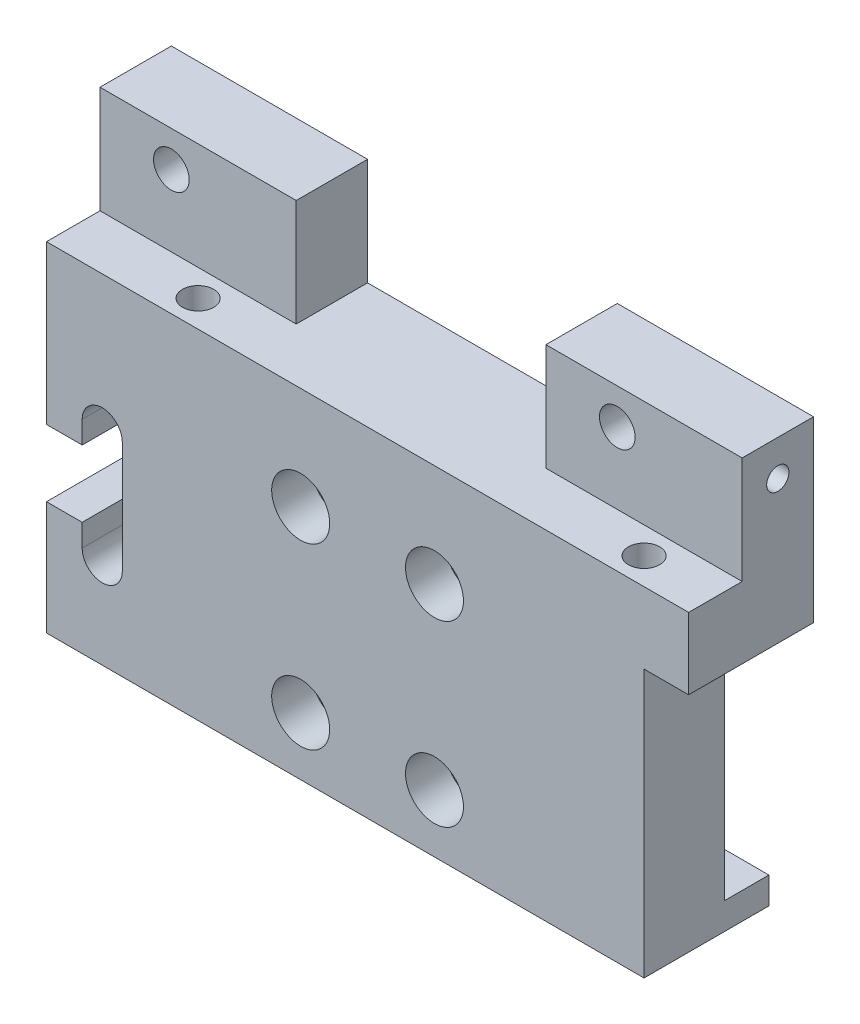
from build123d import *

# Parameters (mm, degrees)
SKETCH_1_R          = 2
SKETCH_1_R_2        = 1.75
EXTRUDE_1_DEPTH     = 14
SKETCH_2_R          = 3.25
CUT_EXTRUDE_1_DEPTH = 4.5
SKETCH_3_OUTSIDE_W  = 33.754
SKETCH_3_OUTSIDE_H  = 69.754
CUT_EXTRUDE_2_DEPTH = 89.769364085
SKETCH_4_R          = 1.25
CUT_EXTRUDE_3_DEPTH = 14
SKETCH_5_R          = 1.5
CUT_EXTRUDE_4_DEPTH = 8
SKETCH_6_R          = 1.75
CUT_EXTRUDE_5_DEPTH = 8


with BuildPart() as part:
    # Sketch 1 → Extrude 1 (new body)
    with BuildSketch(Plane.XY):
        with BuildLine():
            Line((0, 0), (0, 12.75))
            Line((0, 12.75), (4, 12.75))
            Line((4, 12.75), (4, 10.25))
            ThreePointArc((4, 10.25), (6.25, 8), (8.5, 10.25))
            Line((8.5, 10.25), (8.5, 22.75))
            ThreePointArc((8.5, 22.75), (6.25, 25), (4, 22.75))
            Line((4, 22.75), (4, 20.25))
            Line((4, 20.25), (0, 20.25))
            Line((0, 20.25), (0, 50))
            Line((0, 50), (22, 50))
            Line((22, 50), (22, 38))
            Line((22, 38), (50, 38))
            Line((50, 38), (50, 50))
            Line((50, 50), (72, 50))
            Line((72, 50), (72, 30))
            Line((72, 30), (67, 30))
            Line((67, 30), (67, 0))
            Line((67, 0), (0, 0))
        make_face()
        with Locations((8, 46)):
            Circle(SKETCH_1_R, mode=Mode.SUBTRACT)
        with Locations((58, 46)):
            Circle(SKETCH_1_R, mode=Mode.SUBTRACT)
        with Locations((28.5, 6.5)):
            Circle(SKETCH_1_R_2, mode=Mode.SUBTRACT)
        with Locations((43.5, 6.5)):
            Circle(SKETCH_1_R_2, mode=Mode.SUBTRACT)
        with Locations((28.5, 26.5)):
            Circle(SKETCH_1_R_2, mode=Mode.SUBTRACT)
        with Locations((43.5, 26.5)):
            Circle(SKETCH_1_R_2, mode=Mode.SUBTRACT)
    extrude(amount=EXTRUDE_1_DEPTH)

    # Sketch 2 → Cut-Extrude 1 (cut)
    with BuildSketch(Plane.XY.offset(14)):
        with Locations((28.5, 6.5)):
            Circle(SKETCH_2_R)
        with Locations((43.5, 6.5)):
            Circle(SKETCH_2_R)
        with Locations((28.5, 26.5)):
            Circle(SKETCH_2_R)
        with Locations((43.5, 26.5)):
            Circle(SKETCH_2_R)
    extrude(amount=-CUT_EXTRUDE_1_DEPTH, mode=Mode.SUBTRACT)

    # Sketch 3 outside → Cut-Extrude 2 (cut, through all)
    with BuildSketch(Plane(origin=(72, 0, 0), x_dir=(0, 0, -1), z_dir=(1, 0, 0))):
        with Locations((-7, 25)):
            Rectangle(SKETCH_3_OUTSIDE_W, SKETCH_3_OUTSIDE_H)
        Polygon((-8, 38), (-8, 50), (0, 50), (0, 30), (-5, 30), (-5, 3), (0, 3), (0, 0), (-14, 0), (-14, 38), align=None, mode=Mode.SUBTRACT)
    extrude(amount=-CUT_EXTRUDE_2_DEPTH, mode=Mode.SUBTRACT)

    # Sketch 4 → Cut-Extrude 3 (cut)
    with BuildSketch(Plane(origin=(72, 0, 0), x_dir=(0, 0, -1), z_dir=(1, 0, 0))):
        with Locations((-4, 46)):
            Circle(SKETCH_4_R)
    extrude(amount=-CUT_EXTRUDE_3_DEPTH, mode=Mode.SUBTRACT)

    # Sketch 5 → Cut-Extrude 4 (cut)
    with BuildSketch(Plane.ZY):
        with Locations((4, 46)):
            Circle(SKETCH_5_R)
    extrude(amount=-CUT_EXTRUDE_4_DEPTH, mode=Mode.SUBTRACT)

    # Sketch 6 → Cut-Extrude 5 (cut)
    with BuildSketch(Plane(origin=(0, 38, 0), x_dir=(1, 0, 0), z_dir=(0, 1, 0))):
        with Locations(Location((14, -11, 0), (0, 0, 270))):
            Circle(SKETCH_6_R)
        with Locations(Location((64, -11, 0), (0, 0, 270))):
            Circle(SKETCH_6_R)
    extrude(amount=-CUT_EXTRUDE_5_DEPTH, mode=Mode.SUBTRACT)


solid = part.part
